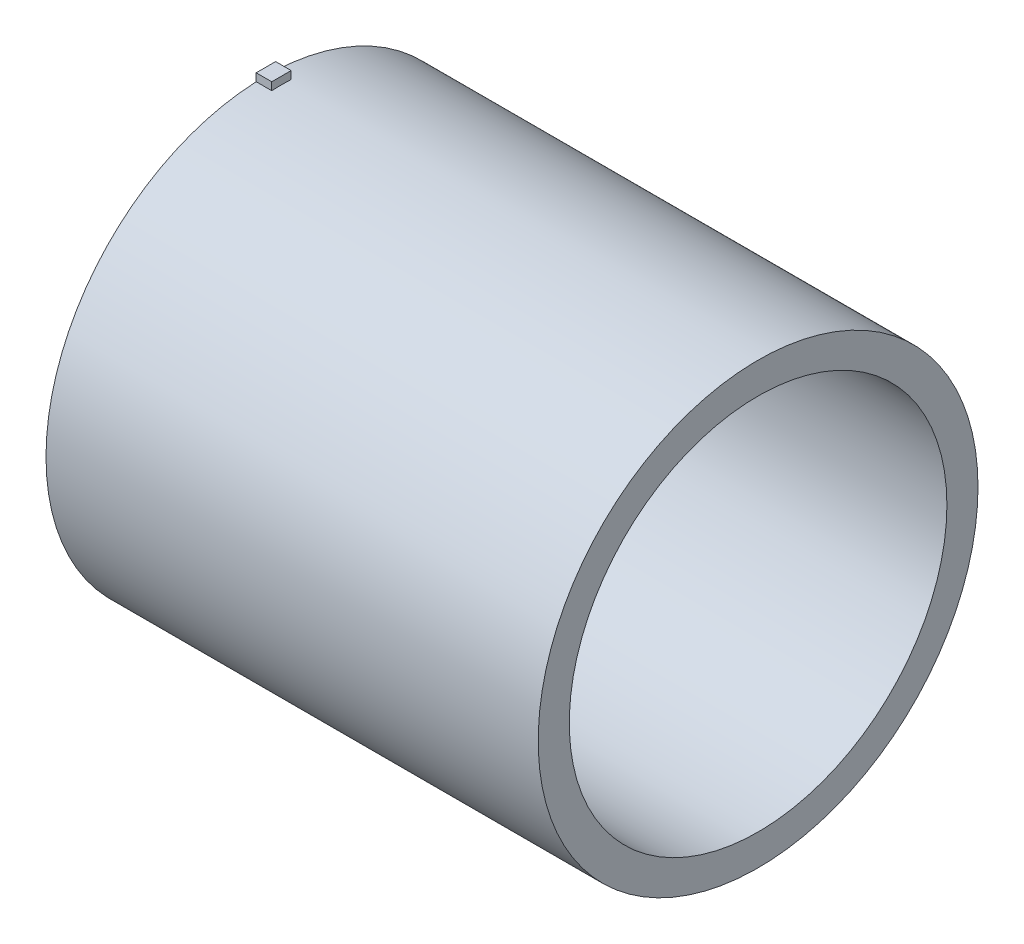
ISO-10303-21;
HEADER;
FILE_DESCRIPTION(('STEP AP214'),'2;1');
FILE_NAME('part.step','',(''),(''),'','','');
FILE_SCHEMA(('AUTOMOTIVE_DESIGN { 1 0 10303 214 1 1 1 1 }'));
ENDSEC;
DATA;
#1=APPLICATION_CONTEXT('core data for automotive mechanical design processes');
#2=APPLICATION_PROTOCOL_DEFINITION('international standard','automotive_design',2000,#1);
#3=PRODUCT_CONTEXT('',#1,'mechanical');
#4=PRODUCT('Part','Part','',(#3));
#5=PRODUCT_RELATED_PRODUCT_CATEGORY('part','',(#4));
#6=PRODUCT_DEFINITION_FORMATION('','',#4);
#7=PRODUCT_DEFINITION_CONTEXT('part definition',#1,'design');
#8=PRODUCT_DEFINITION('design','',#6,#7);
#9=PRODUCT_DEFINITION_SHAPE('','',#8);
#10=(LENGTH_UNIT() NAMED_UNIT(*) SI_UNIT(.MILLI.,.METRE.));
#11=(NAMED_UNIT(*) PLANE_ANGLE_UNIT() SI_UNIT($,.RADIAN.));
#12=(NAMED_UNIT(*) SI_UNIT($,.STERADIAN.) SOLID_ANGLE_UNIT());
#13=UNCERTAINTY_MEASURE_WITH_UNIT(LENGTH_MEASURE(1.E-05),#10,'distance_accuracy_value','');
#14=(GEOMETRIC_REPRESENTATION_CONTEXT(3) GLOBAL_UNCERTAINTY_ASSIGNED_CONTEXT((#13)) GLOBAL_UNIT_ASSIGNED_CONTEXT((#10,
#11,#12)) REPRESENTATION_CONTEXT('',''));
#15=CARTESIAN_POINT('',(0.,0.,0.));
#16=DIRECTION('',(0.,0.,1.));
#17=DIRECTION('',(1.,0.,0.));
#18=AXIS2_PLACEMENT_3D('',#15,#16,#17);
#19=CARTESIAN_POINT('',(0.,37.175923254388,0.));
#20=DIRECTION('',(0.,1.,0.));
#21=DIRECTION('',(0.,0.,1.));
#22=AXIS2_PLACEMENT_3D('',#19,#20,#21);
#23=PLANE('',#22);
#24=DIRECTION('',(0.,0.,-1.));
#25=VECTOR('',#24,1.);
#26=CARTESIAN_POINT('',(0.,37.175923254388,0.));
#27=LINE('',#26,#25);
#28=CARTESIAN_POINT('',(0.,37.175923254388,-1.5875));
#29=VERTEX_POINT('',#28);
#30=CARTESIAN_POINT('',(0.,37.175923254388,1.5875));
#31=VERTEX_POINT('',#30);
#32=EDGE_CURVE('E118',#29,#31,#27,.F.);
#33=ORIENTED_EDGE('',*,*,#32,.T.);
#34=DIRECTION('',(1.,0.,0.));
#35=VECTOR('',#34,1.);
#36=CARTESIAN_POINT('',(0.,37.175923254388,1.5875));
#37=LINE('',#36,#35);
#38=CARTESIAN_POINT('',(2.54,37.175923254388,1.5875));
#39=VERTEX_POINT('',#38);
#40=EDGE_CURVE('E124',#39,#31,#37,.F.);
#41=ORIENTED_EDGE('',*,*,#40,.F.);
#42=DIRECTION('',(0.,0.,-1.));
#43=VECTOR('',#42,1.);
#44=CARTESIAN_POINT('',(2.54,37.175923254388,0.));
#45=LINE('',#44,#43);
#46=CARTESIAN_POINT('',(2.54,37.175923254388,-1.5875));
#47=VERTEX_POINT('',#46);
#48=EDGE_CURVE('E132',#47,#39,#45,.F.);
#49=ORIENTED_EDGE('',*,*,#48,.F.);
#50=DIRECTION('',(1.,0.,0.));
#51=VECTOR('',#50,1.);
#52=CARTESIAN_POINT('',(0.,37.175923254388,-1.5875));
#53=LINE('',#52,#51);
#54=EDGE_CURVE('E138',#29,#47,#53,.T.);
#55=ORIENTED_EDGE('',*,*,#54,.F.);
#56=EDGE_LOOP('',(#33,#41,#49,#55));
#57=FACE_BOUND('',#56,.T.);
#58=ADVANCED_FACE('F17',(#57),#23,.T.);
#59=CARTESIAN_POINT('',(0.,-37.175923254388,0.));
#60=DIRECTION('',(0.,-1.,0.));
#61=DIRECTION('',(0.,0.,-1.));
#62=AXIS2_PLACEMENT_3D('',#59,#60,#61);
#63=PLANE('',#62);
#64=DIRECTION('',(0.,0.,-1.));
#65=VECTOR('',#64,1.);
#66=CARTESIAN_POINT('',(0.,-37.175923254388,0.));
#67=LINE('',#66,#65);
#68=CARTESIAN_POINT('',(0.,-37.175923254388,1.5875));
#69=VERTEX_POINT('',#68);
#70=CARTESIAN_POINT('',(0.,-37.175923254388,-1.5875));
#71=VERTEX_POINT('',#70);
#72=EDGE_CURVE('E105',#69,#71,#67,.T.);
#73=ORIENTED_EDGE('',*,*,#72,.T.);
#74=DIRECTION('',(1.,0.,0.));
#75=VECTOR('',#74,1.);
#76=CARTESIAN_POINT('',(0.,-37.175923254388,-1.5875));
#77=LINE('',#76,#75);
#78=CARTESIAN_POINT('',(2.54,-37.175923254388,-1.5875));
#79=VERTEX_POINT('',#78);
#80=EDGE_CURVE('E78',#79,#71,#77,.F.);
#81=ORIENTED_EDGE('',*,*,#80,.F.);
#82=DIRECTION('',(0.,0.,-1.));
#83=VECTOR('',#82,1.);
#84=CARTESIAN_POINT('',(2.54,-37.175923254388,0.));
#85=LINE('',#84,#83);
#86=CARTESIAN_POINT('',(2.54,-37.175923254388,1.5875));
#87=VERTEX_POINT('',#86);
#88=EDGE_CURVE('E74',#87,#79,#85,.T.);
#89=ORIENTED_EDGE('',*,*,#88,.F.);
#90=DIRECTION('',(1.,0.,0.));
#91=VECTOR('',#90,1.);
#92=CARTESIAN_POINT('',(0.,-37.175923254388,1.5875));
#93=LINE('',#92,#91);
#94=EDGE_CURVE('E147',#69,#87,#93,.T.);
#95=ORIENTED_EDGE('',*,*,#94,.F.);
#96=EDGE_LOOP('',(#73,#81,#89,#95));
#97=FACE_BOUND('',#96,.T.);
#98=ADVANCED_FACE('F274',(#97),#63,.T.);
#99=CARTESIAN_POINT('',(0.,0.,0.));
#100=DIRECTION('',(1.,0.,0.));
#101=DIRECTION('',(0.,0.,-1.));
#102=AXIS2_PLACEMENT_3D('',#99,#100,#101);
#103=CYLINDRICAL_SURFACE('',#102,30.861);
#104=CARTESIAN_POINT('',(0.,0.,0.));
#105=DIRECTION('',(1.,0.,0.));
#106=DIRECTION('',(0.,0.,-1.));
#107=AXIS2_PLACEMENT_3D('',#104,#105,#106);
#108=CIRCLE('',#107,30.861);
#109=CARTESIAN_POINT('',(0.,0.,-30.861));
#110=VERTEX_POINT('',#109);
#111=EDGE_CURVE('E101',#110,#110,#108,.F.);
#112=ORIENTED_EDGE('',*,*,#111,.T.);
#113=EDGE_LOOP('',(#112));
#114=FACE_BOUND('',#113,.T.);
#115=CARTESIAN_POINT('',(80.4418,0.,0.));
#116=DIRECTION('',(1.,0.,0.));
#117=DIRECTION('',(0.,0.,-1.));
#118=AXIS2_PLACEMENT_3D('',#115,#116,#117);
#119=CIRCLE('',#118,30.861);
#120=CARTESIAN_POINT('',(80.4418,0.,-30.861));
#121=VERTEX_POINT('',#120);
#122=EDGE_CURVE('E20',#121,#121,#119,.F.);
#123=ORIENTED_EDGE('',*,*,#122,.F.);
#124=EDGE_LOOP('',(#123));
#125=FACE_BOUND('',#124,.T.);
#126=ADVANCED_FACE('F264',(#114,#125),#103,.F.);
#127=CARTESIAN_POINT('',(80.4418,0.,0.));
#128=DIRECTION('',(1.,0.,0.));
#129=DIRECTION('',(0.,0.,-1.));
#130=AXIS2_PLACEMENT_3D('',#127,#128,#129);
#131=PLANE('',#130);
#132=ORIENTED_EDGE('',*,*,#122,.T.);
#133=EDGE_LOOP('',(#132));
#134=FACE_BOUND('',#133,.T.);
#135=CARTESIAN_POINT('',(80.4418,0.,0.));
#136=DIRECTION('',(1.,0.,0.));
#137=DIRECTION('',(0.,0.,-1.));
#138=AXIS2_PLACEMENT_3D('',#135,#136,#137);
#139=CIRCLE('',#138,35.941);
#140=CARTESIAN_POINT('',(80.4418,0.,-35.941));
#141=VERTEX_POINT('',#140);
#142=EDGE_CURVE('E95',#141,#141,#139,.F.);
#143=ORIENTED_EDGE('',*,*,#142,.F.);
#144=EDGE_LOOP('',(#143));
#145=FACE_BOUND('',#144,.T.);
#146=ADVANCED_FACE('F255',(#134,#145),#131,.T.);
#147=CARTESIAN_POINT('',(0.,-36.540923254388,1.5875));
#148=DIRECTION('',(0.,0.,1.));
#149=DIRECTION('',(0.,-1.,0.));
#150=AXIS2_PLACEMENT_3D('',#147,#148,#149);
#151=PLANE('',#150);
#152=DIRECTION('',(0.,1.,0.));
#153=VECTOR('',#152,1.);
#154=CARTESIAN_POINT('',(0.,0.,1.5875));
#155=LINE('',#154,#153);
#156=CARTESIAN_POINT('',(0.,-35.905923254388,1.5875));
#157=VERTEX_POINT('',#156);
#158=EDGE_CURVE('E108',#157,#69,#155,.F.);
#159=ORIENTED_EDGE('',*,*,#158,.T.);
#160=ORIENTED_EDGE('',*,*,#94,.T.);
#161=DIRECTION('',(0.,1.,0.));
#162=VECTOR('',#161,1.);
#163=CARTESIAN_POINT('',(2.54,-36.540923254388,1.5875));
#164=LINE('',#163,#162);
#165=CARTESIAN_POINT('',(2.54,-35.905923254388,1.5875));
#166=VERTEX_POINT('',#165);
#167=EDGE_CURVE('E60',#166,#87,#164,.F.);
#168=ORIENTED_EDGE('',*,*,#167,.F.);
#169=DIRECTION('',(1.,0.,0.));
#170=VECTOR('',#169,1.);
#171=CARTESIAN_POINT('',(0.,-35.905923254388,1.58750000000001));
#172=LINE('',#171,#170);
#173=EDGE_CURVE('E93',#157,#166,#172,.T.);
#174=ORIENTED_EDGE('',*,*,#173,.F.);
#175=EDGE_LOOP('',(#159,#160,#168,#174));
#176=FACE_BOUND('',#175,.T.);
#177=ADVANCED_FACE('F246',(#176),#151,.T.);
#178=CARTESIAN_POINT('',(2.54,-36.540923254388,0.));
#179=DIRECTION('',(1.,0.,0.));
#180=DIRECTION('',(0.,0.,-1.));
#181=AXIS2_PLACEMENT_3D('',#178,#179,#180);
#182=PLANE('',#181);
#183=ORIENTED_EDGE('',*,*,#88,.T.);
#184=DIRECTION('',(0.,1.,0.));
#185=VECTOR('',#184,1.);
#186=CARTESIAN_POINT('',(2.54,-36.540923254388,-1.5875));
#187=LINE('',#186,#185);
#188=CARTESIAN_POINT('',(2.54,-35.905923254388,-1.5875));
#189=VERTEX_POINT('',#188);
#190=EDGE_CURVE('E66',#189,#79,#187,.F.);
#191=ORIENTED_EDGE('',*,*,#190,.F.);
#192=CARTESIAN_POINT('',(2.54,0.,0.));
#193=DIRECTION('',(1.,0.,0.));
#194=DIRECTION('',(0.,0.,-1.));
#195=AXIS2_PLACEMENT_3D('',#192,#193,#194);
#196=CIRCLE('',#195,35.941);
#197=EDGE_CURVE('E70',#166,#189,#196,.T.);
#198=ORIENTED_EDGE('',*,*,#197,.F.);
#199=ORIENTED_EDGE('',*,*,#167,.T.);
#200=EDGE_LOOP('',(#183,#191,#198,#199));
#201=FACE_BOUND('',#200,.T.);
#202=ADVANCED_FACE('F68',(#201),#182,.T.);
#203=CARTESIAN_POINT('',(0.,-36.540923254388,-1.5875));
#204=DIRECTION('',(0.,0.,-1.));
#205=DIRECTION('',(0.,1.,0.));
#206=AXIS2_PLACEMENT_3D('',#203,#204,#205);
#207=PLANE('',#206);
#208=DIRECTION('',(0.,1.,0.));
#209=VECTOR('',#208,1.);
#210=CARTESIAN_POINT('',(0.,0.,-1.5875));
#211=LINE('',#210,#209);
#212=CARTESIAN_POINT('',(0.,-35.905923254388,-1.5875));
#213=VERTEX_POINT('',#212);
#214=EDGE_CURVE('E84',#71,#213,#211,.T.);
#215=ORIENTED_EDGE('',*,*,#214,.T.);
#216=DIRECTION('',(1.,0.,0.));
#217=VECTOR('',#216,1.);
#218=CARTESIAN_POINT('',(0.,-35.905923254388,-1.58749999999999));
#219=LINE('',#218,#217);
#220=EDGE_CURVE('E81',#189,#213,#219,.F.);
#221=ORIENTED_EDGE('',*,*,#220,.F.);
#222=ORIENTED_EDGE('',*,*,#190,.T.);
#223=ORIENTED_EDGE('',*,*,#80,.T.);
#224=EDGE_LOOP('',(#215,#221,#222,#223));
#225=FACE_BOUND('',#224,.T.);
#226=ADVANCED_FACE('F82',(#225),#207,.T.);
#227=CARTESIAN_POINT('',(0.,36.540923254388,-1.5875));
#228=DIRECTION('',(0.,0.,-1.));
#229=DIRECTION('',(0.,1.,0.));
#230=AXIS2_PLACEMENT_3D('',#227,#228,#229);
#231=PLANE('',#230);
#232=DIRECTION('',(0.,1.,0.));
#233=VECTOR('',#232,1.);
#234=CARTESIAN_POINT('',(0.,0.,-1.5875));
#235=LINE('',#234,#233);
#236=CARTESIAN_POINT('',(0.,35.905923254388,-1.5875));
#237=VERTEX_POINT('',#236);
#238=EDGE_CURVE('E121',#237,#29,#235,.T.);
#239=ORIENTED_EDGE('',*,*,#238,.T.);
#240=ORIENTED_EDGE('',*,*,#54,.T.);
#241=DIRECTION('',(0.,1.,0.));
#242=VECTOR('',#241,1.);
#243=CARTESIAN_POINT('',(2.54,36.540923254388,-1.5875));
#244=LINE('',#243,#242);
#245=CARTESIAN_POINT('',(2.54,35.905923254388,-1.5875));
#246=VERTEX_POINT('',#245);
#247=EDGE_CURVE('E135',#246,#47,#244,.T.);
#248=ORIENTED_EDGE('',*,*,#247,.F.);
#249=DIRECTION('',(1.,0.,0.));
#250=VECTOR('',#249,1.);
#251=CARTESIAN_POINT('',(0.,35.905923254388,-1.5875));
#252=LINE('',#251,#250);
#253=EDGE_CURVE('E141',#237,#246,#252,.T.);
#254=ORIENTED_EDGE('',*,*,#253,.F.);
#255=EDGE_LOOP('',(#239,#240,#248,#254));
#256=FACE_BOUND('',#255,.T.);
#257=ADVANCED_FACE('F195',(#256),#231,.T.);
#258=CARTESIAN_POINT('',(2.54,36.540923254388,0.));
#259=DIRECTION('',(1.,0.,0.));
#260=DIRECTION('',(0.,0.,-1.));
#261=AXIS2_PLACEMENT_3D('',#258,#259,#260);
#262=PLANE('',#261);
#263=ORIENTED_EDGE('',*,*,#48,.T.);
#264=DIRECTION('',(0.,-1.,0.));
#265=VECTOR('',#264,1.);
#266=CARTESIAN_POINT('',(2.54,36.540923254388,1.5875));
#267=LINE('',#266,#265);
#268=CARTESIAN_POINT('',(2.54,35.905923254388,1.5875));
#269=VERTEX_POINT('',#268);
#270=EDGE_CURVE('E129',#269,#39,#267,.F.);
#271=ORIENTED_EDGE('',*,*,#270,.F.);
#272=CARTESIAN_POINT('',(2.54,0.,0.));
#273=DIRECTION('',(1.,0.,0.));
#274=DIRECTION('',(0.,0.,-1.));
#275=AXIS2_PLACEMENT_3D('',#272,#273,#274);
#276=CIRCLE('',#275,35.941);
#277=EDGE_CURVE('E127',#246,#269,#276,.T.);
#278=ORIENTED_EDGE('',*,*,#277,.F.);
#279=ORIENTED_EDGE('',*,*,#247,.T.);
#280=EDGE_LOOP('',(#263,#271,#278,#279));
#281=FACE_BOUND('',#280,.T.);
#282=ADVANCED_FACE('F179',(#281),#262,.T.);
#283=CARTESIAN_POINT('',(0.,36.540923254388,1.5875));
#284=DIRECTION('',(0.,0.,1.));
#285=DIRECTION('',(0.,-1.,0.));
#286=AXIS2_PLACEMENT_3D('',#283,#284,#285);
#287=PLANE('',#286);
#288=DIRECTION('',(0.,1.,0.));
#289=VECTOR('',#288,1.);
#290=CARTESIAN_POINT('',(0.,0.,1.5875));
#291=LINE('',#290,#289);
#292=CARTESIAN_POINT('',(0.,35.905923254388,1.5875));
#293=VERTEX_POINT('',#292);
#294=EDGE_CURVE('E35',#31,#293,#291,.F.);
#295=ORIENTED_EDGE('',*,*,#294,.T.);
#296=DIRECTION('',(1.,0.,0.));
#297=VECTOR('',#296,1.);
#298=CARTESIAN_POINT('',(0.,35.905923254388,1.5875));
#299=LINE('',#298,#297);
#300=EDGE_CURVE('E26',#269,#293,#299,.F.);
#301=ORIENTED_EDGE('',*,*,#300,.F.);
#302=ORIENTED_EDGE('',*,*,#270,.T.);
#303=ORIENTED_EDGE('',*,*,#40,.T.);
#304=EDGE_LOOP('',(#295,#301,#302,#303));
#305=FACE_BOUND('',#304,.T.);
#306=ADVANCED_FACE('F184',(#305),#287,.T.);
#307=CARTESIAN_POINT('',(0.,0.,0.));
#308=DIRECTION('',(1.,0.,0.));
#309=DIRECTION('',(0.,0.,-1.));
#310=AXIS2_PLACEMENT_3D('',#307,#308,#309);
#311=PLANE('',#310);
#312=ORIENTED_EDGE('',*,*,#111,.F.);
#313=EDGE_LOOP('',(#312));
#314=FACE_BOUND('',#313,.T.);
#315=ORIENTED_EDGE('',*,*,#214,.F.);
#316=ORIENTED_EDGE('',*,*,#72,.F.);
#317=ORIENTED_EDGE('',*,*,#158,.F.);
#318=CARTESIAN_POINT('',(0.,0.,0.));
#319=DIRECTION('',(1.,0.,0.));
#320=DIRECTION('',(0.,0.,-1.));
#321=AXIS2_PLACEMENT_3D('',#318,#319,#320);
#322=CIRCLE('',#321,35.941);
#323=EDGE_CURVE('E11',#293,#157,#322,.T.);
#324=ORIENTED_EDGE('',*,*,#323,.F.);
#325=ORIENTED_EDGE('',*,*,#294,.F.);
#326=ORIENTED_EDGE('',*,*,#32,.F.);
#327=ORIENTED_EDGE('',*,*,#238,.F.);
#328=CARTESIAN_POINT('',(0.,0.,0.));
#329=DIRECTION('',(1.,0.,0.));
#330=DIRECTION('',(0.,0.,-1.));
#331=AXIS2_PLACEMENT_3D('',#328,#329,#330);
#332=CIRCLE('',#331,35.941);
#333=EDGE_CURVE('E88',#213,#237,#332,.T.);
#334=ORIENTED_EDGE('',*,*,#333,.F.);
#335=EDGE_LOOP('',(#315,#316,#317,#324,#325,#326,#327,#334));
#336=FACE_BOUND('',#335,.T.);
#337=ADVANCED_FACE('F186',(#314,#336),#311,.F.);
#338=CARTESIAN_POINT('',(0.,0.,0.));
#339=DIRECTION('',(1.,0.,0.));
#340=DIRECTION('',(0.,0.,-1.));
#341=AXIS2_PLACEMENT_3D('',#338,#339,#340);
#342=CYLINDRICAL_SURFACE('',#341,35.941);
#343=ORIENTED_EDGE('',*,*,#300,.T.);
#344=ORIENTED_EDGE('',*,*,#323,.T.);
#345=ORIENTED_EDGE('',*,*,#173,.T.);
#346=ORIENTED_EDGE('',*,*,#197,.T.);
#347=ORIENTED_EDGE('',*,*,#220,.T.);
#348=ORIENTED_EDGE('',*,*,#333,.T.);
#349=ORIENTED_EDGE('',*,*,#253,.T.);
#350=ORIENTED_EDGE('',*,*,#277,.T.);
#351=EDGE_LOOP('',(#343,#344,#345,#346,#347,#348,#349,#350));
#352=FACE_BOUND('',#351,.T.);
#353=ORIENTED_EDGE('',*,*,#142,.T.);
#354=EDGE_LOOP('',(#353));
#355=FACE_BOUND('',#354,.T.);
#356=ADVANCED_FACE('F91',(#352,#355),#342,.T.);
#357=CLOSED_SHELL('',(#58,#98,#126,#146,#177,#202,#226,#257,#282,#306,#337,#356));
#358=MANIFOLD_SOLID_BREP('B1',#357);
#359=ADVANCED_BREP_SHAPE_REPRESENTATION('',(#18,#358),#14);
#360=SHAPE_DEFINITION_REPRESENTATION(#9,#359);
ENDSEC;
END-ISO-10303-21;
